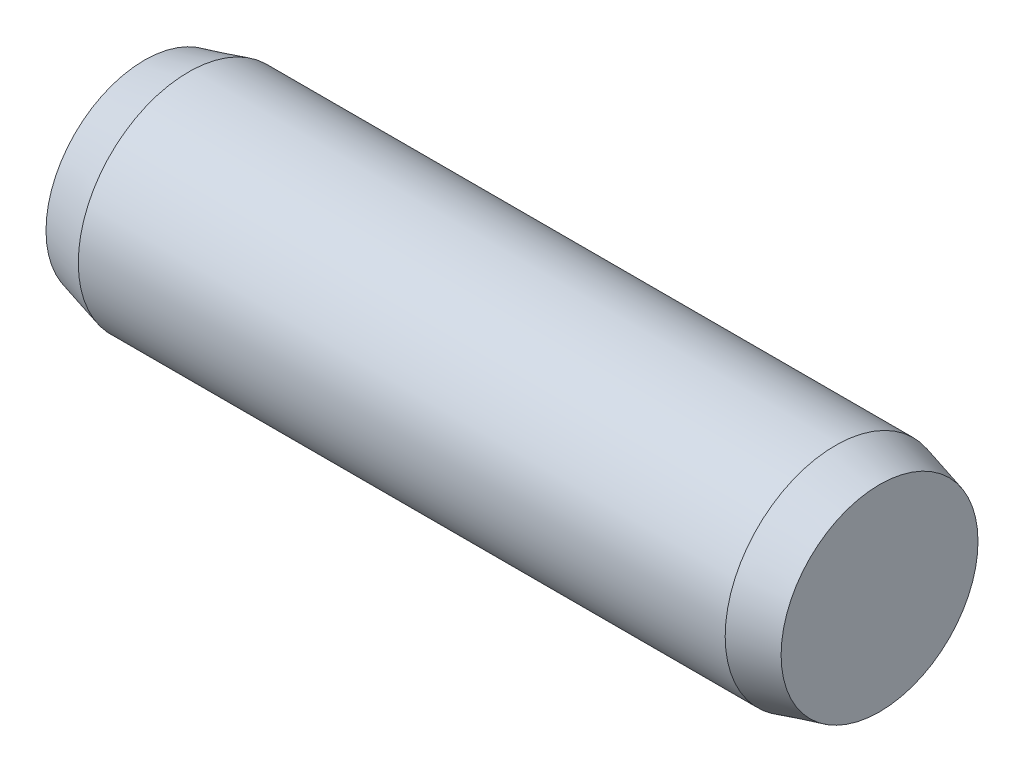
ISO-10303-21;
HEADER;
FILE_DESCRIPTION(('STEP AP214'),'2;1');
FILE_NAME('part.step','',(''),(''),'','','');
FILE_SCHEMA(('AUTOMOTIVE_DESIGN { 1 0 10303 214 1 1 1 1 }'));
ENDSEC;
DATA;
#1=APPLICATION_CONTEXT('core data for automotive mechanical design processes');
#2=APPLICATION_PROTOCOL_DEFINITION('international standard','automotive_design',2000,#1);
#3=PRODUCT_CONTEXT('',#1,'mechanical');
#4=PRODUCT('Part','Part','',(#3));
#5=PRODUCT_RELATED_PRODUCT_CATEGORY('part','',(#4));
#6=PRODUCT_DEFINITION_FORMATION('','',#4);
#7=PRODUCT_DEFINITION_CONTEXT('part definition',#1,'design');
#8=PRODUCT_DEFINITION('design','',#6,#7);
#9=PRODUCT_DEFINITION_SHAPE('','',#8);
#10=(LENGTH_UNIT() NAMED_UNIT(*) SI_UNIT(.MILLI.,.METRE.));
#11=(NAMED_UNIT(*) PLANE_ANGLE_UNIT() SI_UNIT($,.RADIAN.));
#12=(NAMED_UNIT(*) SI_UNIT($,.STERADIAN.) SOLID_ANGLE_UNIT());
#13=UNCERTAINTY_MEASURE_WITH_UNIT(LENGTH_MEASURE(1.E-05),#10,'distance_accuracy_value','');
#14=(GEOMETRIC_REPRESENTATION_CONTEXT(3) GLOBAL_UNCERTAINTY_ASSIGNED_CONTEXT((#13)) GLOBAL_UNIT_ASSIGNED_CONTEXT((#10,
#11,#12)) REPRESENTATION_CONTEXT('',''));
#15=CARTESIAN_POINT('',(0.,0.,0.));
#16=DIRECTION('',(0.,0.,1.));
#17=DIRECTION('',(1.,0.,0.));
#18=AXIS2_PLACEMENT_3D('',#15,#16,#17);
#19=CARTESIAN_POINT('',(0.,0.267846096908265,0.));
#20=DIRECTION('',(1.,0.,0.));
#21=DIRECTION('',(0.,0.,-1.));
#22=AXIS2_PLACEMENT_3D('',#19,#20,#21);
#23=PLANE('',#22);
#24=CARTESIAN_POINT('',(0.,0.,0.));
#25=DIRECTION('',(-1.,0.,0.));
#26=DIRECTION('',(0.,0.,1.));
#27=AXIS2_PLACEMENT_3D('',#24,#25,#26);
#28=CIRCLE('',#27,0.267846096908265);
#29=CARTESIAN_POINT('',(0.,0.,0.267846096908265));
#30=VERTEX_POINT('',#29);
#31=EDGE_CURVE('E42',#30,#30,#28,.T.);
#32=ORIENTED_EDGE('',*,*,#31,.T.);
#33=EDGE_LOOP('',(#32));
#34=FACE_BOUND('',#33,.T.);
#35=ADVANCED_FACE('F28',(#34),#23,.F.);
#36=CARTESIAN_POINT('',(2.,0.,0.));
#37=DIRECTION('',(-1.,0.,0.));
#38=DIRECTION('',(0.,0.,1.));
#39=AXIS2_PLACEMENT_3D('',#36,#37,#38);
#40=PLANE('',#39);
#41=CARTESIAN_POINT('',(2.,0.,0.));
#42=DIRECTION('',(-1.,0.,0.));
#43=DIRECTION('',(0.,0.,1.));
#44=AXIS2_PLACEMENT_3D('',#41,#42,#43);
#45=CIRCLE('',#44,0.267846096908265);
#46=CARTESIAN_POINT('',(2.,0.,0.267846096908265));
#47=VERTEX_POINT('',#46);
#48=EDGE_CURVE('E10',#47,#47,#45,.T.);
#49=ORIENTED_EDGE('',*,*,#48,.F.);
#50=EDGE_LOOP('',(#49));
#51=FACE_BOUND('',#50,.T.);
#52=ADVANCED_FACE('F62',(#51),#40,.F.);
#53=CARTESIAN_POINT('',(2.,0.,0.));
#54=DIRECTION('',(-1.,0.,0.));
#55=DIRECTION('',(0.,0.,1.));
#56=AXIS2_PLACEMENT_3D('',#53,#54,#55);
#57=CONICAL_SURFACE('',#56,0.267846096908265,0.26179938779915);
#58=CARTESIAN_POINT('',(1.88,0.,0.));
#59=DIRECTION('',(-1.,0.,0.));
#60=DIRECTION('',(0.,0.,1.));
#61=AXIS2_PLACEMENT_3D('',#58,#59,#60);
#62=CIRCLE('',#61,0.3);
#63=CARTESIAN_POINT('',(1.88,0.,0.3));
#64=VERTEX_POINT('',#63);
#65=EDGE_CURVE('E34',#64,#64,#62,.T.);
#66=ORIENTED_EDGE('',*,*,#65,.F.);
#67=EDGE_LOOP('',(#66));
#68=FACE_BOUND('',#67,.T.);
#69=ORIENTED_EDGE('',*,*,#48,.T.);
#70=EDGE_LOOP('',(#69));
#71=FACE_BOUND('',#70,.T.);
#72=ADVANCED_FACE('F57',(#68,#71),#57,.T.);
#73=CARTESIAN_POINT('',(-1.65571726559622,0.,0.));
#74=DIRECTION('',(-1.,0.,0.));
#75=DIRECTION('',(0.,0.,1.));
#76=AXIS2_PLACEMENT_3D('',#73,#74,#75);
#77=CYLINDRICAL_SURFACE('',#76,0.3);
#78=CARTESIAN_POINT('',(0.12,0.,0.));
#79=DIRECTION('',(-1.,0.,0.));
#80=DIRECTION('',(0.,0.,1.));
#81=AXIS2_PLACEMENT_3D('',#78,#79,#80);
#82=CIRCLE('',#81,0.3);
#83=CARTESIAN_POINT('',(0.12,0.,0.3));
#84=VERTEX_POINT('',#83);
#85=EDGE_CURVE('E38',#84,#84,#82,.T.);
#86=ORIENTED_EDGE('',*,*,#85,.F.);
#87=EDGE_LOOP('',(#86));
#88=FACE_BOUND('',#87,.T.);
#89=ORIENTED_EDGE('',*,*,#65,.T.);
#90=EDGE_LOOP('',(#89));
#91=FACE_BOUND('',#90,.T.);
#92=ADVANCED_FACE('F52',(#88,#91),#77,.T.);
#93=CARTESIAN_POINT('',(0.12,0.,0.));
#94=DIRECTION('',(1.,0.,0.));
#95=DIRECTION('',(0.,0.,-1.));
#96=AXIS2_PLACEMENT_3D('',#93,#94,#95);
#97=CONICAL_SURFACE('',#96,0.3,0.261799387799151);
#98=ORIENTED_EDGE('',*,*,#31,.F.);
#99=EDGE_LOOP('',(#98));
#100=FACE_BOUND('',#99,.T.);
#101=ORIENTED_EDGE('',*,*,#85,.T.);
#102=EDGE_LOOP('',(#101));
#103=FACE_BOUND('',#102,.T.);
#104=ADVANCED_FACE('F49',(#100,#103),#97,.T.);
#105=CLOSED_SHELL('',(#35,#52,#72,#92,#104));
#106=MANIFOLD_SOLID_BREP('B2',#105);
#107=ADVANCED_BREP_SHAPE_REPRESENTATION('',(#18,#106),#14);
#108=SHAPE_DEFINITION_REPRESENTATION(#9,#107);
ENDSEC;
END-ISO-10303-21;
